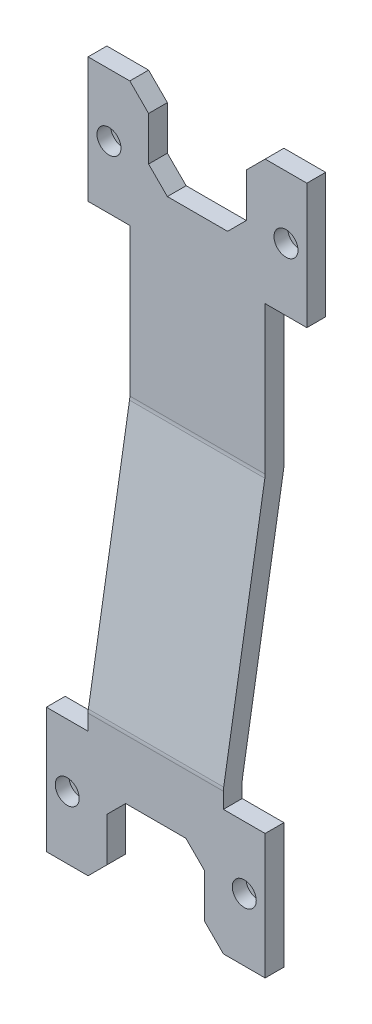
ISO-10303-21;
HEADER;
FILE_DESCRIPTION(('STEP AP214'),'2;1');
FILE_NAME('part.step','',(''),(''),'','','');
FILE_SCHEMA(('AUTOMOTIVE_DESIGN { 1 0 10303 214 1 1 1 1 }'));
ENDSEC;
DATA;
#1=APPLICATION_CONTEXT('core data for automotive mechanical design processes');
#2=APPLICATION_PROTOCOL_DEFINITION('international standard','automotive_design',2000,#1);
#3=PRODUCT_CONTEXT('',#1,'mechanical');
#4=PRODUCT('Part','Part','',(#3));
#5=PRODUCT_RELATED_PRODUCT_CATEGORY('part','',(#4));
#6=PRODUCT_DEFINITION_FORMATION('','',#4);
#7=PRODUCT_DEFINITION_CONTEXT('part definition',#1,'design');
#8=PRODUCT_DEFINITION('design','',#6,#7);
#9=PRODUCT_DEFINITION_SHAPE('','',#8);
#10=(LENGTH_UNIT() NAMED_UNIT(*) SI_UNIT(.MILLI.,.METRE.));
#11=(NAMED_UNIT(*) PLANE_ANGLE_UNIT() SI_UNIT($,.RADIAN.));
#12=(NAMED_UNIT(*) SI_UNIT($,.STERADIAN.) SOLID_ANGLE_UNIT());
#13=UNCERTAINTY_MEASURE_WITH_UNIT(LENGTH_MEASURE(1.E-05),#10,'distance_accuracy_value','');
#14=(GEOMETRIC_REPRESENTATION_CONTEXT(3) GLOBAL_UNCERTAINTY_ASSIGNED_CONTEXT((#13)) GLOBAL_UNIT_ASSIGNED_CONTEXT((#10,
#11,#12)) REPRESENTATION_CONTEXT('',''));
#15=CARTESIAN_POINT('',(0.,0.,0.));
#16=DIRECTION('',(0.,0.,1.));
#17=DIRECTION('',(1.,0.,0.));
#18=AXIS2_PLACEMENT_3D('',#15,#16,#17);
#19=CARTESIAN_POINT('',(21.215663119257,64.99,-15.));
#20=DIRECTION('',(0.,0.,1.));
#21=DIRECTION('',(1.,0.,0.));
#22=AXIS2_PLACEMENT_3D('',#19,#20,#21);
#23=CYLINDRICAL_SURFACE('',#22,1.55);
#24=CARTESIAN_POINT('',(21.215663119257,64.99,-14.5));
#25=DIRECTION('',(0.,0.,1.));
#26=DIRECTION('',(1.,0.,0.));
#27=AXIS2_PLACEMENT_3D('',#24,#25,#26);
#28=CIRCLE('',#27,1.55);
#29=CARTESIAN_POINT('',(22.765663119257,64.99,-14.5));
#30=VERTEX_POINT('',#29);
#31=EDGE_CURVE('E644',#30,#30,#28,.F.);
#32=ORIENTED_EDGE('',*,*,#31,.T.);
#33=EDGE_LOOP('',(#32));
#34=FACE_BOUND('',#33,.T.);
#35=CARTESIAN_POINT('',(21.215663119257,64.99,-13.3));
#36=DIRECTION('',(0.,0.,1.));
#37=DIRECTION('',(1.,0.,0.));
#38=AXIS2_PLACEMENT_3D('',#35,#36,#37);
#39=CIRCLE('',#38,1.55);
#40=CARTESIAN_POINT('',(22.765663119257,64.99,-13.3));
#41=VERTEX_POINT('',#40);
#42=EDGE_CURVE('E347',#41,#41,#39,.F.);
#43=ORIENTED_EDGE('',*,*,#42,.F.);
#44=EDGE_LOOP('',(#43));
#45=FACE_BOUND('',#44,.T.);
#46=ADVANCED_FACE('F36',(#34,#45),#23,.F.);
#47=CARTESIAN_POINT('',(-21.2156631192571,64.99,-15.));
#48=DIRECTION('',(0.,0.,1.));
#49=DIRECTION('',(1.,0.,0.));
#50=AXIS2_PLACEMENT_3D('',#47,#48,#49);
#51=CYLINDRICAL_SURFACE('',#50,1.55);
#52=CARTESIAN_POINT('',(-21.2156631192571,64.99,-14.5));
#53=DIRECTION('',(0.,0.,1.));
#54=DIRECTION('',(1.,0.,0.));
#55=AXIS2_PLACEMENT_3D('',#52,#53,#54);
#56=CIRCLE('',#55,1.55);
#57=CARTESIAN_POINT('',(-19.6656631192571,64.99,-14.5));
#58=VERTEX_POINT('',#57);
#59=EDGE_CURVE('E641',#58,#58,#56,.F.);
#60=ORIENTED_EDGE('',*,*,#59,.T.);
#61=EDGE_LOOP('',(#60));
#62=FACE_BOUND('',#61,.T.);
#63=CARTESIAN_POINT('',(-21.2156631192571,64.99,-13.3));
#64=DIRECTION('',(0.,0.,1.));
#65=DIRECTION('',(1.,0.,0.));
#66=AXIS2_PLACEMENT_3D('',#63,#64,#65);
#67=CIRCLE('',#66,1.55);
#68=CARTESIAN_POINT('',(-19.6656631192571,64.99,-13.3));
#69=VERTEX_POINT('',#68);
#70=EDGE_CURVE('E344',#69,#69,#67,.F.);
#71=ORIENTED_EDGE('',*,*,#70,.F.);
#72=EDGE_LOOP('',(#71));
#73=FACE_BOUND('',#72,.T.);
#74=ADVANCED_FACE('F747',(#62,#73),#51,.F.);
#75=CARTESIAN_POINT('',(-21.215663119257,-64.99,-15.));
#76=DIRECTION('',(0.,0.,1.));
#77=DIRECTION('',(1.,0.,0.));
#78=AXIS2_PLACEMENT_3D('',#75,#76,#77);
#79=CYLINDRICAL_SURFACE('',#78,1.55);
#80=CARTESIAN_POINT('',(-21.215663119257,-64.99,-4.5));
#81=DIRECTION('',(0.,0.,1.));
#82=DIRECTION('',(0.,-1.,0.));
#83=AXIS2_PLACEMENT_3D('',#80,#81,#82);
#84=CIRCLE('',#83,1.55);
#85=CARTESIAN_POINT('',(-21.215663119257,-66.54,-4.5));
#86=VERTEX_POINT('',#85);
#87=EDGE_CURVE('E417',#86,#86,#84,.F.);
#88=ORIENTED_EDGE('',*,*,#87,.T.);
#89=EDGE_LOOP('',(#88));
#90=FACE_BOUND('',#89,.T.);
#91=CARTESIAN_POINT('',(-21.215663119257,-64.99,-3.3));
#92=DIRECTION('',(0.,0.,1.));
#93=DIRECTION('',(1.,0.,0.));
#94=AXIS2_PLACEMENT_3D('',#91,#92,#93);
#95=CIRCLE('',#94,1.55);
#96=CARTESIAN_POINT('',(-19.665663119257,-64.99,-3.3));
#97=VERTEX_POINT('',#96);
#98=EDGE_CURVE('E339',#97,#97,#95,.F.);
#99=ORIENTED_EDGE('',*,*,#98,.F.);
#100=EDGE_LOOP('',(#99));
#101=FACE_BOUND('',#100,.T.);
#102=ADVANCED_FACE('F753',(#90,#101),#79,.F.);
#103=CARTESIAN_POINT('',(21.215663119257,-64.99,-15.));
#104=DIRECTION('',(0.,0.,1.));
#105=DIRECTION('',(1.,0.,0.));
#106=AXIS2_PLACEMENT_3D('',#103,#104,#105);
#107=CYLINDRICAL_SURFACE('',#106,1.55);
#108=CARTESIAN_POINT('',(21.215663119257,-64.99,-4.5));
#109=DIRECTION('',(0.,0.,1.));
#110=DIRECTION('',(0.,-1.,0.));
#111=AXIS2_PLACEMENT_3D('',#108,#109,#110);
#112=CIRCLE('',#111,1.55);
#113=CARTESIAN_POINT('',(21.215663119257,-66.54,-4.5));
#114=VERTEX_POINT('',#113);
#115=EDGE_CURVE('E414',#114,#114,#112,.F.);
#116=ORIENTED_EDGE('',*,*,#115,.T.);
#117=EDGE_LOOP('',(#116));
#118=FACE_BOUND('',#117,.T.);
#119=CARTESIAN_POINT('',(21.215663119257,-64.99,-3.3));
#120=DIRECTION('',(0.,0.,1.));
#121=DIRECTION('',(1.,0.,0.));
#122=AXIS2_PLACEMENT_3D('',#119,#120,#121);
#123=CIRCLE('',#122,1.55);
#124=CARTESIAN_POINT('',(22.765663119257,-64.99,-3.3));
#125=VERTEX_POINT('',#124);
#126=EDGE_CURVE('E336',#125,#125,#123,.F.);
#127=ORIENTED_EDGE('',*,*,#126,.F.);
#128=EDGE_LOOP('',(#127));
#129=FACE_BOUND('',#128,.T.);
#130=ADVANCED_FACE('F758',(#118,#129),#107,.F.);
#131=CARTESIAN_POINT('',(26.2156631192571,-49.99,-5.));
#132=DIRECTION('',(0.,1.,0.));
#133=DIRECTION('',(0.,0.,1.));
#134=AXIS2_PLACEMENT_3D('',#131,#132,#133);
#135=PLANE('',#134);
#136=DIRECTION('',(1.,0.,0.));
#137=VECTOR('',#136,1.);
#138=CARTESIAN_POINT('',(26.2156631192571,-49.99,-4.50000000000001));
#139=LINE('',#138,#137);
#140=CARTESIAN_POINT('',(16.215663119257,-49.99,-4.50000000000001));
#141=VERTEX_POINT('',#140);
#142=CARTESIAN_POINT('',(26.2156631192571,-49.99,-4.50000000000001));
#143=VERTEX_POINT('',#142);
#144=EDGE_CURVE('E389',#141,#143,#139,.T.);
#145=ORIENTED_EDGE('',*,*,#144,.F.);
#146=DIRECTION('',(0.,0.,1.));
#147=VECTOR('',#146,1.);
#148=CARTESIAN_POINT('',(16.215663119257,-49.99,-5.));
#149=LINE('',#148,#147);
#150=CARTESIAN_POINT('',(16.215663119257,-49.99,0.));
#151=VERTEX_POINT('',#150);
#152=EDGE_CURVE('E322',#141,#151,#149,.T.);
#153=ORIENTED_EDGE('',*,*,#152,.T.);
#154=DIRECTION('',(-1.,0.,0.));
#155=VECTOR('',#154,1.);
#156=CARTESIAN_POINT('',(26.2156631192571,-49.99,0.));
#157=LINE('',#156,#155);
#158=CARTESIAN_POINT('',(26.2156631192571,-49.99,0.));
#159=VERTEX_POINT('',#158);
#160=EDGE_CURVE('E387',#159,#151,#157,.T.);
#161=ORIENTED_EDGE('',*,*,#160,.F.);
#162=DIRECTION('',(0.,0.,1.));
#163=VECTOR('',#162,1.);
#164=CARTESIAN_POINT('',(26.2156631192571,-49.99,-5.));
#165=LINE('',#164,#163);
#166=EDGE_CURVE('E328',#143,#159,#165,.T.);
#167=ORIENTED_EDGE('',*,*,#166,.F.);
#168=EDGE_LOOP('',(#145,#153,#161,#167));
#169=FACE_BOUND('',#168,.T.);
#170=ADVANCED_FACE('F38',(#169),#135,.T.);
#171=CARTESIAN_POINT('',(26.2156631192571,-79.99,-5.));
#172=DIRECTION('',(1.,0.,0.));
#173=DIRECTION('',(0.,0.,-1.));
#174=AXIS2_PLACEMENT_3D('',#171,#172,#173);
#175=PLANE('',#174);
#176=DIRECTION('',(0.,-1.,0.));
#177=VECTOR('',#176,1.);
#178=CARTESIAN_POINT('',(26.2156631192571,-79.99,-4.5));
#179=LINE('',#178,#177);
#180=CARTESIAN_POINT('',(26.2156631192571,-79.99,-4.5));
#181=VERTEX_POINT('',#180);
#182=EDGE_CURVE('E279',#143,#181,#179,.T.);
#183=ORIENTED_EDGE('',*,*,#182,.F.);
#184=ORIENTED_EDGE('',*,*,#166,.T.);
#185=DIRECTION('',(0.,1.,0.));
#186=VECTOR('',#185,1.);
#187=CARTESIAN_POINT('',(26.2156631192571,-79.99,0.));
#188=LINE('',#187,#186);
#189=CARTESIAN_POINT('',(26.2156631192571,-79.99,0.));
#190=VERTEX_POINT('',#189);
#191=EDGE_CURVE('E324',#190,#159,#188,.T.);
#192=ORIENTED_EDGE('',*,*,#191,.F.);
#193=DIRECTION('',(0.,0.,1.));
#194=VECTOR('',#193,1.);
#195=CARTESIAN_POINT('',(26.2156631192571,-79.99,-5.));
#196=LINE('',#195,#194);
#197=EDGE_CURVE('E534',#181,#190,#196,.T.);
#198=ORIENTED_EDGE('',*,*,#197,.F.);
#199=EDGE_LOOP('',(#183,#184,#192,#198));
#200=FACE_BOUND('',#199,.T.);
#201=ADVANCED_FACE('F689',(#200),#175,.T.);
#202=CARTESIAN_POINT('',(16.2156631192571,-79.99,-5.));
#203=DIRECTION('',(0.,-1.,0.));
#204=DIRECTION('',(0.,0.,-1.));
#205=AXIS2_PLACEMENT_3D('',#202,#203,#204);
#206=PLANE('',#205);
#207=DIRECTION('',(1.,0.,0.));
#208=VECTOR('',#207,1.);
#209=CARTESIAN_POINT('',(-26.2156631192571,-79.99,-4.5));
#210=LINE('',#209,#208);
#211=CARTESIAN_POINT('',(16.2156631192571,-79.99,-4.5));
#212=VERTEX_POINT('',#211);
#213=EDGE_CURVE('E375',#212,#181,#210,.T.);
#214=ORIENTED_EDGE('',*,*,#213,.T.);
#215=ORIENTED_EDGE('',*,*,#197,.T.);
#216=DIRECTION('',(1.,0.,0.));
#217=VECTOR('',#216,1.);
#218=CARTESIAN_POINT('',(16.2156631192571,-79.99,0.));
#219=LINE('',#218,#217);
#220=CARTESIAN_POINT('',(16.2156631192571,-79.99,0.));
#221=VERTEX_POINT('',#220);
#222=EDGE_CURVE('E529',#221,#190,#219,.T.);
#223=ORIENTED_EDGE('',*,*,#222,.F.);
#224=DIRECTION('',(0.,0.,1.));
#225=VECTOR('',#224,1.);
#226=CARTESIAN_POINT('',(16.2156631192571,-79.99,-5.));
#227=LINE('',#226,#225);
#228=EDGE_CURVE('E536',#212,#221,#227,.T.);
#229=ORIENTED_EDGE('',*,*,#228,.F.);
#230=EDGE_LOOP('',(#214,#215,#223,#229));
#231=FACE_BOUND('',#230,.T.);
#232=ADVANCED_FACE('F684',(#231),#206,.T.);
#233=CARTESIAN_POINT('',(16.2156631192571,-79.99,-5.));
#234=DIRECTION('',(-0.707106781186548,-0.707106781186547,0.));
#235=DIRECTION('',(0.707106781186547,-0.707106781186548,0.));
#236=AXIS2_PLACEMENT_3D('',#233,#234,#235);
#237=PLANE('',#236);
#238=DIRECTION('',(-0.707106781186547,0.707106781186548,0.));
#239=VECTOR('',#238,1.);
#240=CARTESIAN_POINT('',(16.2156631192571,-79.99,-4.5));
#241=LINE('',#240,#239);
#242=CARTESIAN_POINT('',(11.715663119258,-75.4900000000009,-4.5));
#243=VERTEX_POINT('',#242);
#244=EDGE_CURVE('E412',#212,#243,#241,.T.);
#245=ORIENTED_EDGE('',*,*,#244,.F.);
#246=ORIENTED_EDGE('',*,*,#228,.T.);
#247=DIRECTION('',(0.707106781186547,-0.707106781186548,0.));
#248=VECTOR('',#247,1.);
#249=CARTESIAN_POINT('',(16.2156631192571,-79.99,0.));
#250=LINE('',#249,#248);
#251=CARTESIAN_POINT('',(11.715663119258,-75.4900000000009,0.));
#252=VERTEX_POINT('',#251);
#253=EDGE_CURVE('E526',#252,#221,#250,.T.);
#254=ORIENTED_EDGE('',*,*,#253,.F.);
#255=DIRECTION('',(0.,0.,1.));
#256=VECTOR('',#255,1.);
#257=CARTESIAN_POINT('',(11.715663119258,-75.4900000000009,-5.));
#258=LINE('',#257,#256);
#259=EDGE_CURVE('E538',#243,#252,#258,.T.);
#260=ORIENTED_EDGE('',*,*,#259,.F.);
#261=EDGE_LOOP('',(#245,#246,#254,#260));
#262=FACE_BOUND('',#261,.T.);
#263=ADVANCED_FACE('F696',(#262),#237,.T.);
#264=CARTESIAN_POINT('',(11.715663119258,-75.4900000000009,-5.));
#265=DIRECTION('',(-1.,0.,0.));
#266=DIRECTION('',(0.,-1.,0.));
#267=AXIS2_PLACEMENT_3D('',#264,#265,#266);
#268=PLANE('',#267);
#269=DIRECTION('',(0.,1.,0.));
#270=VECTOR('',#269,1.);
#271=CARTESIAN_POINT('',(11.715663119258,-75.4900000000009,-4.5));
#272=LINE('',#271,#270);
#273=CARTESIAN_POINT('',(11.715663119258,-64.99,-4.5));
#274=VERTEX_POINT('',#273);
#275=EDGE_CURVE('E410',#243,#274,#272,.T.);
#276=ORIENTED_EDGE('',*,*,#275,.F.);
#277=ORIENTED_EDGE('',*,*,#259,.T.);
#278=DIRECTION('',(0.,-1.,0.));
#279=VECTOR('',#278,1.);
#280=CARTESIAN_POINT('',(11.715663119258,-75.4900000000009,0.));
#281=LINE('',#280,#279);
#282=CARTESIAN_POINT('',(11.715663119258,-64.99,0.));
#283=VERTEX_POINT('',#282);
#284=EDGE_CURVE('E523',#283,#252,#281,.T.);
#285=ORIENTED_EDGE('',*,*,#284,.F.);
#286=DIRECTION('',(0.,0.,1.));
#287=VECTOR('',#286,1.);
#288=CARTESIAN_POINT('',(11.715663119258,-64.99,-5.));
#289=LINE('',#288,#287);
#290=EDGE_CURVE('E540',#274,#283,#289,.T.);
#291=ORIENTED_EDGE('',*,*,#290,.F.);
#292=EDGE_LOOP('',(#276,#277,#285,#291));
#293=FACE_BOUND('',#292,.T.);
#294=ADVANCED_FACE('F701',(#293),#268,.T.);
#295=CARTESIAN_POINT('',(11.715663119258,-64.99,-5.));
#296=DIRECTION('',(-0.707106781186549,-0.707106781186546,0.));
#297=DIRECTION('',(0.707106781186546,-0.707106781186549,0.));
#298=AXIS2_PLACEMENT_3D('',#295,#296,#297);
#299=PLANE('',#298);
#300=DIRECTION('',(-0.707106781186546,0.707106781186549,0.));
#301=VECTOR('',#300,1.);
#302=CARTESIAN_POINT('',(11.715663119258,-64.99,-4.5));
#303=LINE('',#302,#301);
#304=CARTESIAN_POINT('',(7.21566311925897,-60.4900000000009,-4.5));
#305=VERTEX_POINT('',#304);
#306=EDGE_CURVE('E408',#274,#305,#303,.T.);
#307=ORIENTED_EDGE('',*,*,#306,.F.);
#308=ORIENTED_EDGE('',*,*,#290,.T.);
#309=DIRECTION('',(0.707106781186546,-0.707106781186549,0.));
#310=VECTOR('',#309,1.);
#311=CARTESIAN_POINT('',(11.715663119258,-64.99,0.));
#312=LINE('',#311,#310);
#313=CARTESIAN_POINT('',(7.21566311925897,-60.4900000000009,0.));
#314=VERTEX_POINT('',#313);
#315=EDGE_CURVE('E520',#314,#283,#312,.T.);
#316=ORIENTED_EDGE('',*,*,#315,.F.);
#317=DIRECTION('',(0.,0.,1.));
#318=VECTOR('',#317,1.);
#319=CARTESIAN_POINT('',(7.21566311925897,-60.4900000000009,-5.));
#320=LINE('',#319,#318);
#321=EDGE_CURVE('E542',#305,#314,#320,.T.);
#322=ORIENTED_EDGE('',*,*,#321,.F.);
#323=EDGE_LOOP('',(#307,#308,#316,#322));
#324=FACE_BOUND('',#323,.T.);
#325=ADVANCED_FACE('F704',(#324),#299,.T.);
#326=CARTESIAN_POINT('',(-7.21566311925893,-60.4900000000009,-5.));
#327=DIRECTION('',(0.,-1.,0.));
#328=DIRECTION('',(0.,0.,-1.));
#329=AXIS2_PLACEMENT_3D('',#326,#327,#328);
#330=PLANE('',#329);
#331=DIRECTION('',(-1.,0.,0.));
#332=VECTOR('',#331,1.);
#333=CARTESIAN_POINT('',(-7.21566311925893,-60.4900000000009,-4.5));
#334=LINE('',#333,#332);
#335=CARTESIAN_POINT('',(-7.21566311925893,-60.4900000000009,-4.5));
#336=VERTEX_POINT('',#335);
#337=EDGE_CURVE('E406',#305,#336,#334,.T.);
#338=ORIENTED_EDGE('',*,*,#337,.F.);
#339=ORIENTED_EDGE('',*,*,#321,.T.);
#340=DIRECTION('',(1.,0.,0.));
#341=VECTOR('',#340,1.);
#342=CARTESIAN_POINT('',(-7.21566311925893,-60.4900000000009,0.));
#343=LINE('',#342,#341);
#344=CARTESIAN_POINT('',(-7.21566311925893,-60.4900000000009,0.));
#345=VERTEX_POINT('',#344);
#346=EDGE_CURVE('E517',#345,#314,#343,.T.);
#347=ORIENTED_EDGE('',*,*,#346,.F.);
#348=DIRECTION('',(0.,0.,1.));
#349=VECTOR('',#348,1.);
#350=CARTESIAN_POINT('',(-7.21566311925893,-60.4900000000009,-5.));
#351=LINE('',#350,#349);
#352=EDGE_CURVE('E544',#336,#345,#351,.T.);
#353=ORIENTED_EDGE('',*,*,#352,.F.);
#354=EDGE_LOOP('',(#338,#339,#347,#353));
#355=FACE_BOUND('',#354,.T.);
#356=ADVANCED_FACE('F710',(#355),#330,.T.);
#357=CARTESIAN_POINT('',(-11.715663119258,-64.99,-5.));
#358=DIRECTION('',(0.707106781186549,-0.707106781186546,0.));
#359=DIRECTION('',(0.707106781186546,0.707106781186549,0.));
#360=AXIS2_PLACEMENT_3D('',#357,#358,#359);
#361=PLANE('',#360);
#362=DIRECTION('',(-0.707106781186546,-0.707106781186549,0.));
#363=VECTOR('',#362,1.);
#364=CARTESIAN_POINT('',(-11.715663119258,-64.99,-4.5));
#365=LINE('',#364,#363);
#366=CARTESIAN_POINT('',(-11.715663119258,-64.99,-4.5));
#367=VERTEX_POINT('',#366);
#368=EDGE_CURVE('E404',#336,#367,#365,.T.);
#369=ORIENTED_EDGE('',*,*,#368,.F.);
#370=ORIENTED_EDGE('',*,*,#352,.T.);
#371=DIRECTION('',(0.707106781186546,0.707106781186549,0.));
#372=VECTOR('',#371,1.);
#373=CARTESIAN_POINT('',(-11.715663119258,-64.99,0.));
#374=LINE('',#373,#372);
#375=CARTESIAN_POINT('',(-11.715663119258,-64.99,0.));
#376=VERTEX_POINT('',#375);
#377=EDGE_CURVE('E514',#376,#345,#374,.T.);
#378=ORIENTED_EDGE('',*,*,#377,.F.);
#379=DIRECTION('',(0.,0.,1.));
#380=VECTOR('',#379,1.);
#381=CARTESIAN_POINT('',(-11.715663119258,-64.99,-5.));
#382=LINE('',#381,#380);
#383=EDGE_CURVE('E546',#367,#376,#382,.T.);
#384=ORIENTED_EDGE('',*,*,#383,.F.);
#385=EDGE_LOOP('',(#369,#370,#378,#384));
#386=FACE_BOUND('',#385,.T.);
#387=ADVANCED_FACE('F714',(#386),#361,.T.);
#388=CARTESIAN_POINT('',(-11.715663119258,-75.4900000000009,-5.));
#389=DIRECTION('',(1.,0.,0.));
#390=DIRECTION('',(0.,0.,-1.));
#391=AXIS2_PLACEMENT_3D('',#388,#389,#390);
#392=PLANE('',#391);
#393=DIRECTION('',(0.,-1.,0.));
#394=VECTOR('',#393,1.);
#395=CARTESIAN_POINT('',(-11.715663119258,-75.4900000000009,-4.5));
#396=LINE('',#395,#394);
#397=CARTESIAN_POINT('',(-11.715663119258,-75.4900000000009,-4.5));
#398=VERTEX_POINT('',#397);
#399=EDGE_CURVE('E402',#367,#398,#396,.T.);
#400=ORIENTED_EDGE('',*,*,#399,.F.);
#401=ORIENTED_EDGE('',*,*,#383,.T.);
#402=DIRECTION('',(0.,1.,0.));
#403=VECTOR('',#402,1.);
#404=CARTESIAN_POINT('',(-11.715663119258,-75.4900000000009,0.));
#405=LINE('',#404,#403);
#406=CARTESIAN_POINT('',(-11.715663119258,-75.4900000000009,0.));
#407=VERTEX_POINT('',#406);
#408=EDGE_CURVE('E511',#407,#376,#405,.T.);
#409=ORIENTED_EDGE('',*,*,#408,.F.);
#410=DIRECTION('',(0.,0.,1.));
#411=VECTOR('',#410,1.);
#412=CARTESIAN_POINT('',(-11.715663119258,-75.4900000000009,-5.));
#413=LINE('',#412,#411);
#414=EDGE_CURVE('E548',#398,#407,#413,.T.);
#415=ORIENTED_EDGE('',*,*,#414,.F.);
#416=EDGE_LOOP('',(#400,#401,#409,#415));
#417=FACE_BOUND('',#416,.T.);
#418=ADVANCED_FACE('F720',(#417),#392,.T.);
#419=CARTESIAN_POINT('',(-16.215663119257,-79.99,-5.));
#420=DIRECTION('',(0.707106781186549,-0.707106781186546,0.));
#421=DIRECTION('',(0.707106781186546,0.707106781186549,0.));
#422=AXIS2_PLACEMENT_3D('',#419,#420,#421);
#423=PLANE('',#422);
#424=DIRECTION('',(-0.707106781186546,-0.707106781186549,0.));
#425=VECTOR('',#424,1.);
#426=CARTESIAN_POINT('',(-16.215663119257,-79.99,-4.5));
#427=LINE('',#426,#425);
#428=CARTESIAN_POINT('',(-16.215663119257,-79.99,-4.5));
#429=VERTEX_POINT('',#428);
#430=EDGE_CURVE('E400',#398,#429,#427,.T.);
#431=ORIENTED_EDGE('',*,*,#430,.F.);
#432=ORIENTED_EDGE('',*,*,#414,.T.);
#433=DIRECTION('',(0.707106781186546,0.707106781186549,0.));
#434=VECTOR('',#433,1.);
#435=CARTESIAN_POINT('',(-16.215663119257,-79.99,0.));
#436=LINE('',#435,#434);
#437=CARTESIAN_POINT('',(-16.215663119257,-79.99,0.));
#438=VERTEX_POINT('',#437);
#439=EDGE_CURVE('E508',#438,#407,#436,.T.);
#440=ORIENTED_EDGE('',*,*,#439,.F.);
#441=DIRECTION('',(0.,0.,1.));
#442=VECTOR('',#441,1.);
#443=CARTESIAN_POINT('',(-16.215663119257,-79.99,-5.));
#444=LINE('',#443,#442);
#445=EDGE_CURVE('E550',#429,#438,#444,.T.);
#446=ORIENTED_EDGE('',*,*,#445,.F.);
#447=EDGE_LOOP('',(#431,#432,#440,#446));
#448=FACE_BOUND('',#447,.T.);
#449=ADVANCED_FACE('F724',(#448),#423,.T.);
#450=CARTESIAN_POINT('',(-26.215663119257,-79.99,-5.));
#451=DIRECTION('',(0.,-1.,0.));
#452=DIRECTION('',(0.,0.,-1.));
#453=AXIS2_PLACEMENT_3D('',#450,#451,#452);
#454=PLANE('',#453);
#455=CARTESIAN_POINT('',(-26.2156631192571,-79.99,-4.5));
#456=VERTEX_POINT('',#455);
#457=EDGE_CURVE('E665',#456,#429,#210,.T.);
#458=ORIENTED_EDGE('',*,*,#457,.T.);
#459=ORIENTED_EDGE('',*,*,#445,.T.);
#460=DIRECTION('',(1.,0.,0.));
#461=VECTOR('',#460,1.);
#462=CARTESIAN_POINT('',(-26.215663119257,-79.99,0.));
#463=LINE('',#462,#461);
#464=CARTESIAN_POINT('',(-26.215663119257,-79.99,0.));
#465=VERTEX_POINT('',#464);
#466=EDGE_CURVE('E505',#465,#438,#463,.T.);
#467=ORIENTED_EDGE('',*,*,#466,.F.);
#468=DIRECTION('',(0.,0.,1.));
#469=VECTOR('',#468,1.);
#470=CARTESIAN_POINT('',(-26.215663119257,-79.99,-5.));
#471=LINE('',#470,#469);
#472=EDGE_CURVE('E552',#456,#465,#471,.T.);
#473=ORIENTED_EDGE('',*,*,#472,.F.);
#474=EDGE_LOOP('',(#458,#459,#467,#473));
#475=FACE_BOUND('',#474,.T.);
#476=ADVANCED_FACE('F847',(#475),#454,.T.);
#477=CARTESIAN_POINT('',(-26.215663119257,-49.99,-5.));
#478=DIRECTION('',(-1.,0.,0.));
#479=DIRECTION('',(0.,-1.,0.));
#480=AXIS2_PLACEMENT_3D('',#477,#478,#479);
#481=PLANE('',#480);
#482=DIRECTION('',(0.,-1.,0.));
#483=VECTOR('',#482,1.);
#484=CARTESIAN_POINT('',(-26.2156631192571,-46.6462528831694,-4.5));
#485=LINE('',#484,#483);
#486=CARTESIAN_POINT('',(-26.2156631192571,-49.99,-4.50000000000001));
#487=VERTEX_POINT('',#486);
#488=EDGE_CURVE('E278',#487,#456,#485,.T.);
#489=ORIENTED_EDGE('',*,*,#488,.T.);
#490=ORIENTED_EDGE('',*,*,#472,.T.);
#491=DIRECTION('',(0.,-1.,0.));
#492=VECTOR('',#491,1.);
#493=CARTESIAN_POINT('',(-26.215663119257,-49.99,0.));
#494=LINE('',#493,#492);
#495=CARTESIAN_POINT('',(-26.215663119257,-49.99,0.));
#496=VERTEX_POINT('',#495);
#497=EDGE_CURVE('E502',#496,#465,#494,.T.);
#498=ORIENTED_EDGE('',*,*,#497,.F.);
#499=DIRECTION('',(0.,0.,1.));
#500=VECTOR('',#499,1.);
#501=CARTESIAN_POINT('',(-26.215663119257,-49.99,-5.));
#502=LINE('',#501,#500);
#503=EDGE_CURVE('E554',#487,#496,#502,.T.);
#504=ORIENTED_EDGE('',*,*,#503,.F.);
#505=EDGE_LOOP('',(#489,#490,#498,#504));
#506=FACE_BOUND('',#505,.T.);
#507=ADVANCED_FACE('F731',(#506),#481,.T.);
#508=CARTESIAN_POINT('',(-16.215663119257,-49.99,-5.));
#509=DIRECTION('',(0.,1.,0.));
#510=DIRECTION('',(0.,0.,1.));
#511=AXIS2_PLACEMENT_3D('',#508,#509,#510);
#512=PLANE('',#511);
#513=DIRECTION('',(1.,0.,0.));
#514=VECTOR('',#513,1.);
#515=CARTESIAN_POINT('',(-16.215663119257,-49.99,-4.50000000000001));
#516=LINE('',#515,#514);
#517=CARTESIAN_POINT('',(-16.215663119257,-49.99,-4.50000000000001));
#518=VERTEX_POINT('',#517);
#519=EDGE_CURVE('E393',#487,#518,#516,.T.);
#520=ORIENTED_EDGE('',*,*,#519,.F.);
#521=ORIENTED_EDGE('',*,*,#503,.T.);
#522=DIRECTION('',(-1.,0.,0.));
#523=VECTOR('',#522,1.);
#524=CARTESIAN_POINT('',(-16.215663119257,-49.99,0.));
#525=LINE('',#524,#523);
#526=CARTESIAN_POINT('',(-16.215663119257,-49.99,0.));
#527=VERTEX_POINT('',#526);
#528=EDGE_CURVE('E499',#527,#496,#525,.T.);
#529=ORIENTED_EDGE('',*,*,#528,.F.);
#530=DIRECTION('',(0.,0.,1.));
#531=VECTOR('',#530,1.);
#532=CARTESIAN_POINT('',(-16.215663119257,-49.99,-5.));
#533=LINE('',#532,#531);
#534=EDGE_CURVE('E556',#518,#527,#533,.T.);
#535=ORIENTED_EDGE('',*,*,#534,.F.);
#536=EDGE_LOOP('',(#520,#521,#529,#535));
#537=FACE_BOUND('',#536,.T.);
#538=ADVANCED_FACE('F728',(#537),#512,.T.);
#539=CARTESIAN_POINT('',(-16.215663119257,49.99,-5.));
#540=DIRECTION('',(-1.,0.,0.));
#541=DIRECTION('',(0.,0.,1.));
#542=AXIS2_PLACEMENT_3D('',#539,#540,#541);
#543=PLANE('',#542);
#544=DIRECTION('',(0.,1.,0.));
#545=VECTOR('',#544,1.);
#546=CARTESIAN_POINT('',(-16.215663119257,49.99,-4.50000000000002));
#547=LINE('',#546,#545);
#548=CARTESIAN_POINT('',(-16.215663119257,-46.6462528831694,-4.5));
#549=VERTEX_POINT('',#548);
#550=EDGE_CURVE('E374',#518,#549,#547,.T.);
#551=ORIENTED_EDGE('',*,*,#550,.F.);
#552=ORIENTED_EDGE('',*,*,#534,.T.);
#553=DIRECTION('',(0.,-1.,0.));
#554=VECTOR('',#553,1.);
#555=CARTESIAN_POINT('',(-16.215663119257,49.99,0.));
#556=LINE('',#555,#554);
#557=CARTESIAN_POINT('',(-16.215663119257,-46.2324402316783,0.));
#558=VERTEX_POINT('',#557);
#559=EDGE_CURVE('E496',#558,#527,#556,.T.);
#560=ORIENTED_EDGE('',*,*,#559,.F.);
#561=CARTESIAN_POINT('',(-16.215663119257,-46.2324402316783,-5.00000000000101));
#562=DIRECTION('',(-1.,0.,0.));
#563=DIRECTION('',(0.,0.,1.));
#564=AXIS2_PLACEMENT_3D('',#561,#562,#563);
#565=CIRCLE('',#564,5.00000000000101);
#566=CARTESIAN_POINT('',(-16.215663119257,-45.4104452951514,-0.0680303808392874));
#567=VERTEX_POINT('',#566);
#568=EDGE_CURVE('E59',#567,#558,#565,.F.);
#569=ORIENTED_EDGE('',*,*,#568,.F.);
#570=DIRECTION('',(0.,-0.986393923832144,0.164398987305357));
#571=VECTOR('',#570,1.);
#572=CARTESIAN_POINT('',(-16.215663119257,48.2113884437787,-15.6716693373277));
#573=LINE('',#572,#571);
#574=CARTESIAN_POINT('',(-16.215663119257,13.7731901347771,-9.93196961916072));
#575=VERTEX_POINT('',#574);
#576=EDGE_CURVE('E456',#575,#567,#573,.T.);
#577=ORIENTED_EDGE('',*,*,#576,.F.);
#578=CARTESIAN_POINT('',(-16.215663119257,14.595185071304,-4.99999999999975));
#579=DIRECTION('',(-1.,0.,0.));
#580=DIRECTION('',(0.,0.,1.));
#581=AXIS2_PLACEMENT_3D('',#578,#579,#580);
#582=CIRCLE('',#581,5.00000000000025);
#583=CARTESIAN_POINT('',(-16.215663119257,14.5951850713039,-10.));
#584=VERTEX_POINT('',#583);
#585=EDGE_CURVE('E458',#584,#575,#582,.T.);
#586=ORIENTED_EDGE('',*,*,#585,.F.);
#587=DIRECTION('',(0.,-1.,0.));
#588=VECTOR('',#587,1.);
#589=CARTESIAN_POINT('',(-16.215663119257,49.99,-9.99999999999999));
#590=LINE('',#589,#588);
#591=CARTESIAN_POINT('',(-16.215663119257,49.99,-9.99999999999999));
#592=VERTEX_POINT('',#591);
#593=EDGE_CURVE('E492',#592,#584,#590,.T.);
#594=ORIENTED_EDGE('',*,*,#593,.F.);
#595=DIRECTION('',(0.,0.,1.));
#596=VECTOR('',#595,1.);
#597=CARTESIAN_POINT('',(-16.215663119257,49.99,-5.));
#598=LINE('',#597,#596);
#599=CARTESIAN_POINT('',(-16.215663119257,49.99,-14.5));
#600=VERTEX_POINT('',#599);
#601=EDGE_CURVE('E297',#600,#592,#598,.T.);
#602=ORIENTED_EDGE('',*,*,#601,.F.);
#603=DIRECTION('',(0.,1.,0.));
#604=VECTOR('',#603,1.);
#605=CARTESIAN_POINT('',(-16.215663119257,49.99,-14.5));
#606=LINE('',#605,#604);
#607=CARTESIAN_POINT('',(-16.215663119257,14.1813724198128,-14.5));
#608=VERTEX_POINT('',#607);
#609=EDGE_CURVE('E635',#608,#600,#606,.T.);
#610=ORIENTED_EDGE('',*,*,#609,.F.);
#611=CARTESIAN_POINT('',(-16.215663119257,14.1813724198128,-10.));
#612=DIRECTION('',(-1.,0.,0.));
#613=DIRECTION('',(0.,0.,1.));
#614=AXIS2_PLACEMENT_3D('',#611,#612,#613);
#615=CIRCLE('',#614,4.5);
#616=CARTESIAN_POINT('',(-16.215663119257,13.4415769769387,-14.4387726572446));
#617=VERTEX_POINT('',#616);
#618=EDGE_CURVE('E647',#617,#608,#615,.F.);
#619=ORIENTED_EDGE('',*,*,#618,.F.);
#620=DIRECTION('',(0.,0.986393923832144,-0.164398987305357));
#621=VECTOR('',#620,1.);
#622=CARTESIAN_POINT('',(-16.215663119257,47.4715930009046,-20.1104419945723));
#623=LINE('',#622,#621);
#624=CARTESIAN_POINT('',(-16.215663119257,-45.7420584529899,-4.57483341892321));
#625=VERTEX_POINT('',#624);
#626=EDGE_CURVE('E395',#625,#617,#623,.T.);
#627=ORIENTED_EDGE('',*,*,#626,.F.);
#628=CARTESIAN_POINT('',(-16.215663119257,-46.6462528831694,-10.));
#629=DIRECTION('',(-1.,0.,0.));
#630=DIRECTION('',(0.,0.,1.));
#631=AXIS2_PLACEMENT_3D('',#628,#629,#630);
#632=CIRCLE('',#631,5.5);
#633=EDGE_CURVE('E391',#549,#625,#632,.T.);
#634=ORIENTED_EDGE('',*,*,#633,.F.);
#635=EDGE_LOOP('',(#551,#552,#560,#569,#577,#586,#594,#602,#610,#619,#627,#634));
#636=FACE_BOUND('',#635,.T.);
#637=ADVANCED_FACE('F568',(#636),#543,.T.);
#638=CARTESIAN_POINT('',(-26.215663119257,49.99,-5.));
#639=DIRECTION('',(0.,-1.,0.));
#640=DIRECTION('',(0.,0.,-1.));
#641=AXIS2_PLACEMENT_3D('',#638,#639,#640);
#642=PLANE('',#641);
#643=DIRECTION('',(-1.,0.,0.));
#644=VECTOR('',#643,1.);
#645=CARTESIAN_POINT('',(-26.215663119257,49.99,-14.5));
#646=LINE('',#645,#644);
#647=CARTESIAN_POINT('',(-26.2156631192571,49.99,-14.5));
#648=VERTEX_POINT('',#647);
#649=EDGE_CURVE('E274',#600,#648,#646,.T.);
#650=ORIENTED_EDGE('',*,*,#649,.F.);
#651=ORIENTED_EDGE('',*,*,#601,.T.);
#652=DIRECTION('',(1.,0.,0.));
#653=VECTOR('',#652,1.);
#654=CARTESIAN_POINT('',(-26.215663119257,49.99,-9.99999999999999));
#655=LINE('',#654,#653);
#656=CARTESIAN_POINT('',(-26.2156631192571,49.99,-9.99999999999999));
#657=VERTEX_POINT('',#656);
#658=EDGE_CURVE('E489',#657,#592,#655,.T.);
#659=ORIENTED_EDGE('',*,*,#658,.F.);
#660=DIRECTION('',(0.,0.,1.));
#661=VECTOR('',#660,1.);
#662=CARTESIAN_POINT('',(-26.215663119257,49.99,-5.));
#663=LINE('',#662,#661);
#664=EDGE_CURVE('E295',#648,#657,#663,.T.);
#665=ORIENTED_EDGE('',*,*,#664,.F.);
#666=EDGE_LOOP('',(#650,#651,#659,#665));
#667=FACE_BOUND('',#666,.T.);
#668=ADVANCED_FACE('F560',(#667),#642,.T.);
#669=CARTESIAN_POINT('',(-26.215663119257,79.99,-5.));
#670=DIRECTION('',(-1.,0.,0.));
#671=DIRECTION('',(0.,-1.,0.));
#672=AXIS2_PLACEMENT_3D('',#669,#670,#671);
#673=PLANE('',#672);
#674=DIRECTION('',(0.,-1.,0.));
#675=VECTOR('',#674,1.);
#676=CARTESIAN_POINT('',(-26.2156631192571,79.99,-14.5));
#677=LINE('',#676,#675);
#678=CARTESIAN_POINT('',(-26.2156631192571,79.99,-14.5));
#679=VERTEX_POINT('',#678);
#680=EDGE_CURVE('E267',#679,#648,#677,.T.);
#681=ORIENTED_EDGE('',*,*,#680,.T.);
#682=ORIENTED_EDGE('',*,*,#664,.T.);
#683=DIRECTION('',(0.,1.,0.));
#684=VECTOR('',#683,1.);
#685=CARTESIAN_POINT('',(-26.2156631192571,79.9948804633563,-9.99999999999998));
#686=LINE('',#685,#684);
#687=CARTESIAN_POINT('',(-26.2156631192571,79.99,-9.99999999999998));
#688=VERTEX_POINT('',#687);
#689=EDGE_CURVE('E294',#657,#688,#686,.T.);
#690=ORIENTED_EDGE('',*,*,#689,.T.);
#691=DIRECTION('',(0.,0.,1.));
#692=VECTOR('',#691,1.);
#693=CARTESIAN_POINT('',(-26.215663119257,79.99,-5.));
#694=LINE('',#693,#692);
#695=EDGE_CURVE('E285',#679,#688,#694,.T.);
#696=ORIENTED_EDGE('',*,*,#695,.F.);
#697=EDGE_LOOP('',(#681,#682,#690,#696));
#698=FACE_BOUND('',#697,.T.);
#699=ADVANCED_FACE('F292',(#698),#673,.T.);
#700=CARTESIAN_POINT('',(-16.215663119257,79.99,-5.));
#701=DIRECTION('',(0.,1.,0.));
#702=DIRECTION('',(0.,0.,1.));
#703=AXIS2_PLACEMENT_3D('',#700,#701,#702);
#704=PLANE('',#703);
#705=DIRECTION('',(1.,0.,0.));
#706=VECTOR('',#705,1.);
#707=CARTESIAN_POINT('',(-26.2156631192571,79.99,-14.5));
#708=LINE('',#707,#706);
#709=CARTESIAN_POINT('',(-16.215663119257,79.99,-14.5));
#710=VERTEX_POINT('',#709);
#711=EDGE_CURVE('E271',#679,#710,#708,.T.);
#712=ORIENTED_EDGE('',*,*,#711,.F.);
#713=ORIENTED_EDGE('',*,*,#695,.T.);
#714=DIRECTION('',(-1.,0.,0.));
#715=VECTOR('',#714,1.);
#716=CARTESIAN_POINT('',(-16.215663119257,79.99,-9.99999999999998));
#717=LINE('',#716,#715);
#718=CARTESIAN_POINT('',(-16.215663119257,79.99,-9.99999999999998));
#719=VERTEX_POINT('',#718);
#720=EDGE_CURVE('E487',#719,#688,#717,.T.);
#721=ORIENTED_EDGE('',*,*,#720,.F.);
#722=DIRECTION('',(0.,0.,1.));
#723=VECTOR('',#722,1.);
#724=CARTESIAN_POINT('',(-16.215663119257,79.99,-5.));
#725=LINE('',#724,#723);
#726=EDGE_CURVE('E287',#710,#719,#725,.T.);
#727=ORIENTED_EDGE('',*,*,#726,.F.);
#728=EDGE_LOOP('',(#712,#713,#721,#727));
#729=FACE_BOUND('',#728,.T.);
#730=ADVANCED_FACE('F283',(#729),#704,.T.);
#731=CARTESIAN_POINT('',(-16.215663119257,79.99,-5.));
#732=DIRECTION('',(0.707106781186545,0.70710678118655,0.));
#733=DIRECTION('',(-0.70710678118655,0.707106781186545,0.));
#734=AXIS2_PLACEMENT_3D('',#731,#732,#733);
#735=PLANE('',#734);
#736=DIRECTION('',(0.70710678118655,-0.707106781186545,0.));
#737=VECTOR('',#736,1.);
#738=CARTESIAN_POINT('',(-16.215663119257,79.99,-14.5));
#739=LINE('',#738,#737);
#740=CARTESIAN_POINT('',(-11.715663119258,75.4900000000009,-14.5));
#741=VERTEX_POINT('',#740);
#742=EDGE_CURVE('E633',#710,#741,#739,.T.);
#743=ORIENTED_EDGE('',*,*,#742,.F.);
#744=ORIENTED_EDGE('',*,*,#726,.T.);
#745=DIRECTION('',(-0.70710678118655,0.707106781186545,0.));
#746=VECTOR('',#745,1.);
#747=CARTESIAN_POINT('',(-16.215663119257,79.99,-9.99999999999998));
#748=LINE('',#747,#746);
#749=CARTESIAN_POINT('',(-11.715663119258,75.4900000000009,-9.99999999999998));
#750=VERTEX_POINT('',#749);
#751=EDGE_CURVE('E484',#750,#719,#748,.T.);
#752=ORIENTED_EDGE('',*,*,#751,.F.);
#753=DIRECTION('',(0.,0.,1.));
#754=VECTOR('',#753,1.);
#755=CARTESIAN_POINT('',(-11.715663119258,75.4900000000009,-5.));
#756=LINE('',#755,#754);
#757=EDGE_CURVE('E299',#741,#750,#756,.T.);
#758=ORIENTED_EDGE('',*,*,#757,.F.);
#759=EDGE_LOOP('',(#743,#744,#752,#758));
#760=FACE_BOUND('',#759,.T.);
#761=ADVANCED_FACE('F632',(#760),#735,.T.);
#762=CARTESIAN_POINT('',(-11.715663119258,75.4900000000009,-5.));
#763=DIRECTION('',(1.,0.,0.));
#764=DIRECTION('',(0.,0.,-1.));
#765=AXIS2_PLACEMENT_3D('',#762,#763,#764);
#766=PLANE('',#765);
#767=DIRECTION('',(0.,-1.,0.));
#768=VECTOR('',#767,1.);
#769=CARTESIAN_POINT('',(-11.715663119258,75.4900000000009,-14.5));
#770=LINE('',#769,#768);
#771=CARTESIAN_POINT('',(-11.715663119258,64.99,-14.5));
#772=VERTEX_POINT('',#771);
#773=EDGE_CURVE('E630',#741,#772,#770,.T.);
#774=ORIENTED_EDGE('',*,*,#773,.F.);
#775=ORIENTED_EDGE('',*,*,#757,.T.);
#776=DIRECTION('',(0.,1.,0.));
#777=VECTOR('',#776,1.);
#778=CARTESIAN_POINT('',(-11.715663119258,75.4900000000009,-9.99999999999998));
#779=LINE('',#778,#777);
#780=CARTESIAN_POINT('',(-11.715663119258,64.99,-9.99999999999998));
#781=VERTEX_POINT('',#780);
#782=EDGE_CURVE('E481',#781,#750,#779,.T.);
#783=ORIENTED_EDGE('',*,*,#782,.F.);
#784=DIRECTION('',(0.,0.,1.));
#785=VECTOR('',#784,1.);
#786=CARTESIAN_POINT('',(-11.715663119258,64.99,-5.));
#787=LINE('',#786,#785);
#788=EDGE_CURVE('E304',#772,#781,#787,.T.);
#789=ORIENTED_EDGE('',*,*,#788,.F.);
#790=EDGE_LOOP('',(#774,#775,#783,#789));
#791=FACE_BOUND('',#790,.T.);
#792=ADVANCED_FACE('F628',(#791),#766,.T.);
#793=CARTESIAN_POINT('',(-11.715663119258,64.99,-5.));
#794=DIRECTION('',(0.707106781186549,0.707106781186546,0.));
#795=DIRECTION('',(-0.707106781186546,0.707106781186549,0.));
#796=AXIS2_PLACEMENT_3D('',#793,#794,#795);
#797=PLANE('',#796);
#798=DIRECTION('',(0.707106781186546,-0.707106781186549,0.));
#799=VECTOR('',#798,1.);
#800=CARTESIAN_POINT('',(-11.715663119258,64.99,-14.5));
#801=LINE('',#800,#799);
#802=CARTESIAN_POINT('',(-7.21566311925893,60.4900000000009,-14.5));
#803=VERTEX_POINT('',#802);
#804=EDGE_CURVE('E622',#772,#803,#801,.T.);
#805=ORIENTED_EDGE('',*,*,#804,.F.);
#806=ORIENTED_EDGE('',*,*,#788,.T.);
#807=DIRECTION('',(-0.707106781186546,0.707106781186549,0.));
#808=VECTOR('',#807,1.);
#809=CARTESIAN_POINT('',(-11.715663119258,64.99,-9.99999999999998));
#810=LINE('',#809,#808);
#811=CARTESIAN_POINT('',(-7.21566311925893,60.4900000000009,-9.99999999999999));
#812=VERTEX_POINT('',#811);
#813=EDGE_CURVE('E478',#812,#781,#810,.T.);
#814=ORIENTED_EDGE('',*,*,#813,.F.);
#815=DIRECTION('',(0.,0.,1.));
#816=VECTOR('',#815,1.);
#817=CARTESIAN_POINT('',(-7.21566311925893,60.4900000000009,-5.));
#818=LINE('',#817,#816);
#819=EDGE_CURVE('E306',#803,#812,#818,.T.);
#820=ORIENTED_EDGE('',*,*,#819,.F.);
#821=EDGE_LOOP('',(#805,#806,#814,#820));
#822=FACE_BOUND('',#821,.T.);
#823=ADVANCED_FACE('F621',(#822),#797,.T.);
#824=CARTESIAN_POINT('',(-7.21566311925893,60.4900000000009,-5.));
#825=DIRECTION('',(0.,1.,0.));
#826=DIRECTION('',(0.,0.,1.));
#827=AXIS2_PLACEMENT_3D('',#824,#825,#826);
#828=PLANE('',#827);
#829=DIRECTION('',(1.,0.,0.));
#830=VECTOR('',#829,1.);
#831=CARTESIAN_POINT('',(-7.21566311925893,60.4900000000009,-14.5));
#832=LINE('',#831,#830);
#833=CARTESIAN_POINT('',(7.21566311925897,60.4900000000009,-14.5));
#834=VERTEX_POINT('',#833);
#835=EDGE_CURVE('E618',#803,#834,#832,.T.);
#836=ORIENTED_EDGE('',*,*,#835,.F.);
#837=ORIENTED_EDGE('',*,*,#819,.T.);
#838=DIRECTION('',(-1.,0.,0.));
#839=VECTOR('',#838,1.);
#840=CARTESIAN_POINT('',(-7.21566311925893,60.4900000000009,-9.99999999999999));
#841=LINE('',#840,#839);
#842=CARTESIAN_POINT('',(7.21566311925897,60.4900000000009,-9.99999999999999));
#843=VERTEX_POINT('',#842);
#844=EDGE_CURVE('E475',#843,#812,#841,.T.);
#845=ORIENTED_EDGE('',*,*,#844,.F.);
#846=DIRECTION('',(0.,0.,1.));
#847=VECTOR('',#846,1.);
#848=CARTESIAN_POINT('',(7.21566311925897,60.4900000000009,-5.));
#849=LINE('',#848,#847);
#850=EDGE_CURVE('E308',#834,#843,#849,.T.);
#851=ORIENTED_EDGE('',*,*,#850,.F.);
#852=EDGE_LOOP('',(#836,#837,#845,#851));
#853=FACE_BOUND('',#852,.T.);
#854=ADVANCED_FACE('F616',(#853),#828,.T.);
#855=CARTESIAN_POINT('',(11.715663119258,64.99,-5.));
#856=DIRECTION('',(-0.707106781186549,0.707106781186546,0.));
#857=DIRECTION('',(-0.707106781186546,-0.707106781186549,0.));
#858=AXIS2_PLACEMENT_3D('',#855,#856,#857);
#859=PLANE('',#858);
#860=DIRECTION('',(0.707106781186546,0.707106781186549,0.));
#861=VECTOR('',#860,1.);
#862=CARTESIAN_POINT('',(11.715663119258,64.99,-14.5));
#863=LINE('',#862,#861);
#864=CARTESIAN_POINT('',(11.715663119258,64.99,-14.5));
#865=VERTEX_POINT('',#864);
#866=EDGE_CURVE('E610',#834,#865,#863,.T.);
#867=ORIENTED_EDGE('',*,*,#866,.F.);
#868=ORIENTED_EDGE('',*,*,#850,.T.);
#869=DIRECTION('',(-0.707106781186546,-0.707106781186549,0.));
#870=VECTOR('',#869,1.);
#871=CARTESIAN_POINT('',(11.715663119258,64.99,-9.99999999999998));
#872=LINE('',#871,#870);
#873=CARTESIAN_POINT('',(11.715663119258,64.99,-9.99999999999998));
#874=VERTEX_POINT('',#873);
#875=EDGE_CURVE('E472',#874,#843,#872,.T.);
#876=ORIENTED_EDGE('',*,*,#875,.F.);
#877=DIRECTION('',(0.,0.,1.));
#878=VECTOR('',#877,1.);
#879=CARTESIAN_POINT('',(11.715663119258,64.99,-5.));
#880=LINE('',#879,#878);
#881=EDGE_CURVE('E310',#865,#874,#880,.T.);
#882=ORIENTED_EDGE('',*,*,#881,.F.);
#883=EDGE_LOOP('',(#867,#868,#876,#882));
#884=FACE_BOUND('',#883,.T.);
#885=ADVANCED_FACE('F609',(#884),#859,.T.);
#886=CARTESIAN_POINT('',(11.715663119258,75.4900000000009,-5.));
#887=DIRECTION('',(-1.,0.,0.));
#888=DIRECTION('',(0.,-1.,0.));
#889=AXIS2_PLACEMENT_3D('',#886,#887,#888);
#890=PLANE('',#889);
#891=DIRECTION('',(0.,1.,0.));
#892=VECTOR('',#891,1.);
#893=CARTESIAN_POINT('',(11.715663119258,75.4900000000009,-14.5));
#894=LINE('',#893,#892);
#895=CARTESIAN_POINT('',(11.715663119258,75.4900000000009,-14.5));
#896=VERTEX_POINT('',#895);
#897=EDGE_CURVE('E606',#865,#896,#894,.T.);
#898=ORIENTED_EDGE('',*,*,#897,.F.);
#899=ORIENTED_EDGE('',*,*,#881,.T.);
#900=DIRECTION('',(0.,-1.,0.));
#901=VECTOR('',#900,1.);
#902=CARTESIAN_POINT('',(11.715663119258,75.4900000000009,-9.99999999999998));
#903=LINE('',#902,#901);
#904=CARTESIAN_POINT('',(11.715663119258,75.4900000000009,-9.99999999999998));
#905=VERTEX_POINT('',#904);
#906=EDGE_CURVE('E469',#905,#874,#903,.T.);
#907=ORIENTED_EDGE('',*,*,#906,.F.);
#908=DIRECTION('',(0.,0.,1.));
#909=VECTOR('',#908,1.);
#910=CARTESIAN_POINT('',(11.715663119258,75.4900000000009,-5.));
#911=LINE('',#910,#909);
#912=EDGE_CURVE('E312',#896,#905,#911,.T.);
#913=ORIENTED_EDGE('',*,*,#912,.F.);
#914=EDGE_LOOP('',(#898,#899,#907,#913));
#915=FACE_BOUND('',#914,.T.);
#916=ADVANCED_FACE('F604',(#915),#890,.T.);
#917=CARTESIAN_POINT('',(16.2156631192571,79.99,-5.));
#918=DIRECTION('',(-0.707106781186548,0.707106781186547,0.));
#919=DIRECTION('',(-0.707106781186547,-0.707106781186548,0.));
#920=AXIS2_PLACEMENT_3D('',#917,#918,#919);
#921=PLANE('',#920);
#922=DIRECTION('',(0.707106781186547,0.707106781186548,0.));
#923=VECTOR('',#922,1.);
#924=CARTESIAN_POINT('',(16.2156631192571,79.99,-14.5));
#925=LINE('',#924,#923);
#926=CARTESIAN_POINT('',(16.2156631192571,79.99,-14.5));
#927=VERTEX_POINT('',#926);
#928=EDGE_CURVE('E598',#896,#927,#925,.T.);
#929=ORIENTED_EDGE('',*,*,#928,.F.);
#930=ORIENTED_EDGE('',*,*,#912,.T.);
#931=DIRECTION('',(-0.707106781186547,-0.707106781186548,0.));
#932=VECTOR('',#931,1.);
#933=CARTESIAN_POINT('',(16.2156631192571,79.99,-9.99999999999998));
#934=LINE('',#933,#932);
#935=CARTESIAN_POINT('',(16.2156631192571,79.99,-9.99999999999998));
#936=VERTEX_POINT('',#935);
#937=EDGE_CURVE('E466',#936,#905,#934,.T.);
#938=ORIENTED_EDGE('',*,*,#937,.F.);
#939=DIRECTION('',(0.,0.,1.));
#940=VECTOR('',#939,1.);
#941=CARTESIAN_POINT('',(16.2156631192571,79.99,-5.));
#942=LINE('',#941,#940);
#943=EDGE_CURVE('E314',#927,#936,#942,.T.);
#944=ORIENTED_EDGE('',*,*,#943,.F.);
#945=EDGE_LOOP('',(#929,#930,#938,#944));
#946=FACE_BOUND('',#945,.T.);
#947=ADVANCED_FACE('F597',(#946),#921,.T.);
#948=CARTESIAN_POINT('',(26.215663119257,79.99,-5.));
#949=DIRECTION('',(0.,1.,0.));
#950=DIRECTION('',(0.,0.,1.));
#951=AXIS2_PLACEMENT_3D('',#948,#949,#950);
#952=PLANE('',#951);
#953=CARTESIAN_POINT('',(26.215663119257,79.99,-14.5));
#954=VERTEX_POINT('',#953);
#955=EDGE_CURVE('E289',#927,#954,#708,.T.);
#956=ORIENTED_EDGE('',*,*,#955,.F.);
#957=ORIENTED_EDGE('',*,*,#943,.T.);
#958=DIRECTION('',(-1.,0.,0.));
#959=VECTOR('',#958,1.);
#960=CARTESIAN_POINT('',(26.215663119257,79.99,-9.99999999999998));
#961=LINE('',#960,#959);
#962=CARTESIAN_POINT('',(26.215663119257,79.99,-9.99999999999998));
#963=VERTEX_POINT('',#962);
#964=EDGE_CURVE('E463',#963,#936,#961,.T.);
#965=ORIENTED_EDGE('',*,*,#964,.F.);
#966=DIRECTION('',(0.,0.,1.));
#967=VECTOR('',#966,1.);
#968=CARTESIAN_POINT('',(26.215663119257,79.99,-5.));
#969=LINE('',#968,#967);
#970=EDGE_CURVE('E316',#954,#963,#969,.T.);
#971=ORIENTED_EDGE('',*,*,#970,.F.);
#972=EDGE_LOOP('',(#956,#957,#965,#971));
#973=FACE_BOUND('',#972,.T.);
#974=ADVANCED_FACE('F593',(#973),#952,.T.);
#975=CARTESIAN_POINT('',(26.215663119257,49.99,-5.));
#976=DIRECTION('',(1.,0.,0.));
#977=DIRECTION('',(0.,1.,0.));
#978=AXIS2_PLACEMENT_3D('',#975,#976,#977);
#979=PLANE('',#978);
#980=DIRECTION('',(0.,-1.,0.));
#981=VECTOR('',#980,1.);
#982=CARTESIAN_POINT('',(26.215663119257,49.99,-14.5));
#983=LINE('',#982,#981);
#984=CARTESIAN_POINT('',(26.215663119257,49.99,-14.5));
#985=VERTEX_POINT('',#984);
#986=EDGE_CURVE('E587',#954,#985,#983,.T.);
#987=ORIENTED_EDGE('',*,*,#986,.F.);
#988=ORIENTED_EDGE('',*,*,#970,.T.);
#989=DIRECTION('',(0.,1.,0.));
#990=VECTOR('',#989,1.);
#991=CARTESIAN_POINT('',(26.215663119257,79.9948804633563,-9.99999999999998));
#992=LINE('',#991,#990);
#993=CARTESIAN_POINT('',(26.215663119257,49.99,-9.99999999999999));
#994=VERTEX_POINT('',#993);
#995=EDGE_CURVE('E343',#994,#963,#992,.T.);
#996=ORIENTED_EDGE('',*,*,#995,.F.);
#997=DIRECTION('',(0.,0.,1.));
#998=VECTOR('',#997,1.);
#999=CARTESIAN_POINT('',(26.215663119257,49.99,-5.));
#1000=LINE('',#999,#998);
#1001=EDGE_CURVE('E318',#985,#994,#1000,.T.);
#1002=ORIENTED_EDGE('',*,*,#1001,.F.);
#1003=EDGE_LOOP('',(#987,#988,#996,#1002));
#1004=FACE_BOUND('',#1003,.T.);
#1005=ADVANCED_FACE('F586',(#1004),#979,.T.);
#1006=CARTESIAN_POINT('',(16.215663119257,49.99,-5.));
#1007=DIRECTION('',(0.,-1.,0.));
#1008=DIRECTION('',(0.,0.,-1.));
#1009=AXIS2_PLACEMENT_3D('',#1006,#1007,#1008);
#1010=PLANE('',#1009);
#1011=DIRECTION('',(-1.,0.,0.));
#1012=VECTOR('',#1011,1.);
#1013=CARTESIAN_POINT('',(16.215663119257,49.99,-14.5));
#1014=LINE('',#1013,#1012);
#1015=CARTESIAN_POINT('',(16.215663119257,49.99,-14.5));
#1016=VERTEX_POINT('',#1015);
#1017=EDGE_CURVE('E51',#985,#1016,#1014,.T.);
#1018=ORIENTED_EDGE('',*,*,#1017,.F.);
#1019=ORIENTED_EDGE('',*,*,#1001,.T.);
#1020=DIRECTION('',(1.,0.,0.));
#1021=VECTOR('',#1020,1.);
#1022=CARTESIAN_POINT('',(16.215663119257,49.99,-9.99999999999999));
#1023=LINE('',#1022,#1021);
#1024=CARTESIAN_POINT('',(16.215663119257,49.99,-9.99999999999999));
#1025=VERTEX_POINT('',#1024);
#1026=EDGE_CURVE('E460',#1025,#994,#1023,.T.);
#1027=ORIENTED_EDGE('',*,*,#1026,.F.);
#1028=DIRECTION('',(0.,0.,1.));
#1029=VECTOR('',#1028,1.);
#1030=CARTESIAN_POINT('',(16.215663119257,49.99,-5.));
#1031=LINE('',#1030,#1029);
#1032=EDGE_CURVE('E320',#1016,#1025,#1031,.T.);
#1033=ORIENTED_EDGE('',*,*,#1032,.F.);
#1034=EDGE_LOOP('',(#1018,#1019,#1027,#1033));
#1035=FACE_BOUND('',#1034,.T.);
#1036=ADVANCED_FACE('F582',(#1035),#1010,.T.);
#1037=CARTESIAN_POINT('',(16.215663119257,-49.99,-5.));
#1038=DIRECTION('',(1.,0.,0.));
#1039=DIRECTION('',(0.,0.,-1.));
#1040=AXIS2_PLACEMENT_3D('',#1037,#1038,#1039);
#1041=PLANE('',#1040);
#1042=DIRECTION('',(0.,-1.,0.));
#1043=VECTOR('',#1042,1.);
#1044=CARTESIAN_POINT('',(16.215663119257,-49.99,-4.50000000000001));
#1045=LINE('',#1044,#1043);
#1046=CARTESIAN_POINT('',(16.215663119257,-46.6462528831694,-4.5));
#1047=VERTEX_POINT('',#1046);
#1048=EDGE_CURVE('E11',#1047,#141,#1045,.T.);
#1049=ORIENTED_EDGE('',*,*,#1048,.F.);
#1050=CARTESIAN_POINT('',(16.215663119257,-46.6462528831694,-10.));
#1051=DIRECTION('',(1.,0.,0.));
#1052=DIRECTION('',(0.,0.,-1.));
#1053=AXIS2_PLACEMENT_3D('',#1050,#1051,#1052);
#1054=CIRCLE('',#1053,5.5);
#1055=CARTESIAN_POINT('',(16.215663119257,-45.7420584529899,-4.57483341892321));
#1056=VERTEX_POINT('',#1055);
#1057=EDGE_CURVE('E44',#1056,#1047,#1054,.T.);
#1058=ORIENTED_EDGE('',*,*,#1057,.F.);
#1059=DIRECTION('',(0.,-0.986393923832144,0.164398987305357));
#1060=VECTOR('',#1059,1.);
#1061=CARTESIAN_POINT('',(16.215663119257,-49.8062448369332,-3.89746902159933));
#1062=LINE('',#1061,#1060);
#1063=CARTESIAN_POINT('',(16.215663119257,13.4415769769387,-14.4387726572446));
#1064=VERTEX_POINT('',#1063);
#1065=EDGE_CURVE('E355',#1064,#1056,#1062,.T.);
#1066=ORIENTED_EDGE('',*,*,#1065,.F.);
#1067=CARTESIAN_POINT('',(16.215663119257,14.1813724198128,-10.));
#1068=DIRECTION('',(1.,0.,0.));
#1069=DIRECTION('',(0.,0.,-1.));
#1070=AXIS2_PLACEMENT_3D('',#1067,#1068,#1069);
#1071=CIRCLE('',#1070,4.5);
#1072=CARTESIAN_POINT('',(16.215663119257,14.1813724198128,-14.5));
#1073=VERTEX_POINT('',#1072);
#1074=EDGE_CURVE('E353',#1073,#1064,#1071,.F.);
#1075=ORIENTED_EDGE('',*,*,#1074,.F.);
#1076=DIRECTION('',(0.,-1.,0.));
#1077=VECTOR('',#1076,1.);
#1078=CARTESIAN_POINT('',(16.215663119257,-49.99,-14.5));
#1079=LINE('',#1078,#1077);
#1080=EDGE_CURVE('E335',#1016,#1073,#1079,.T.);
#1081=ORIENTED_EDGE('',*,*,#1080,.F.);
#1082=ORIENTED_EDGE('',*,*,#1032,.T.);
#1083=DIRECTION('',(0.,1.,0.));
#1084=VECTOR('',#1083,1.);
#1085=CARTESIAN_POINT('',(16.215663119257,-49.99,-10.));
#1086=LINE('',#1085,#1084);
#1087=CARTESIAN_POINT('',(16.215663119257,14.5951850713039,-10.));
#1088=VERTEX_POINT('',#1087);
#1089=EDGE_CURVE('E332',#1088,#1025,#1086,.T.);
#1090=ORIENTED_EDGE('',*,*,#1089,.F.);
#1091=CARTESIAN_POINT('',(16.215663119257,14.595185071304,-4.99999999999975));
#1092=DIRECTION('',(1.,0.,0.));
#1093=DIRECTION('',(0.,0.,-1.));
#1094=AXIS2_PLACEMENT_3D('',#1091,#1092,#1093);
#1095=CIRCLE('',#1094,5.00000000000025);
#1096=CARTESIAN_POINT('',(16.215663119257,13.7731901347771,-9.93196961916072));
#1097=VERTEX_POINT('',#1096);
#1098=EDGE_CURVE('E330',#1097,#1088,#1095,.T.);
#1099=ORIENTED_EDGE('',*,*,#1098,.F.);
#1100=DIRECTION('',(0.,0.986393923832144,-0.164398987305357));
#1101=VECTOR('',#1100,1.);
#1102=CARTESIAN_POINT('',(16.215663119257,-49.0664493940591,0.541303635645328));
#1103=LINE('',#1102,#1101);
#1104=CARTESIAN_POINT('',(16.215663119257,-45.4104452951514,-0.0680303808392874));
#1105=VERTEX_POINT('',#1104);
#1106=EDGE_CURVE('E327',#1105,#1097,#1103,.T.);
#1107=ORIENTED_EDGE('',*,*,#1106,.F.);
#1108=CARTESIAN_POINT('',(16.215663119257,-46.2324402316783,-5.00000000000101));
#1109=DIRECTION('',(1.,0.,0.));
#1110=DIRECTION('',(0.,0.,-1.));
#1111=AXIS2_PLACEMENT_3D('',#1108,#1109,#1110);
#1112=CIRCLE('',#1111,5.00000000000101);
#1113=CARTESIAN_POINT('',(16.215663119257,-46.2324402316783,0.));
#1114=VERTEX_POINT('',#1113);
#1115=EDGE_CURVE('E448',#1114,#1105,#1112,.F.);
#1116=ORIENTED_EDGE('',*,*,#1115,.F.);
#1117=DIRECTION('',(0.,1.,0.));
#1118=VECTOR('',#1117,1.);
#1119=CARTESIAN_POINT('',(16.215663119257,-49.99,0.));
#1120=LINE('',#1119,#1118);
#1121=EDGE_CURVE('E382',#151,#1114,#1120,.T.);
#1122=ORIENTED_EDGE('',*,*,#1121,.F.);
#1123=ORIENTED_EDGE('',*,*,#152,.F.);
#1124=EDGE_LOOP('',(#1049,#1058,#1066,#1075,#1081,#1082,#1090,#1099,#1107,#1116,#1122,#1123));
#1125=FACE_BOUND('',#1124,.T.);
#1126=ADVANCED_FACE('F378',(#1125),#1041,.T.);
#1127=CARTESIAN_POINT('',(0.,0.,0.));
#1128=DIRECTION('',(0.,0.,-1.));
#1129=DIRECTION('',(-1.,0.,0.));
#1130=AXIS2_PLACEMENT_3D('',#1127,#1128,#1129);
#1131=PLANE('',#1130);
#1132=CARTESIAN_POINT('',(-21.215663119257,-64.99,0.));
#1133=DIRECTION('',(0.,0.,1.));
#1134=DIRECTION('',(1.,0.,0.));
#1135=AXIS2_PLACEMENT_3D('',#1132,#1133,#1134);
#1136=CIRCLE('',#1135,2.875);
#1137=CARTESIAN_POINT('',(-18.340663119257,-64.99,0.));
#1138=VERTEX_POINT('',#1137);
#1139=EDGE_CURVE('E431',#1138,#1138,#1136,.T.);
#1140=ORIENTED_EDGE('',*,*,#1139,.F.);
#1141=EDGE_LOOP('',(#1140));
#1142=FACE_BOUND('',#1141,.T.);
#1143=CARTESIAN_POINT('',(21.215663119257,-64.99,0.));
#1144=DIRECTION('',(0.,0.,1.));
#1145=DIRECTION('',(1.,0.,0.));
#1146=AXIS2_PLACEMENT_3D('',#1143,#1144,#1145);
#1147=CIRCLE('',#1146,2.875);
#1148=CARTESIAN_POINT('',(24.090663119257,-64.99,0.));
#1149=VERTEX_POINT('',#1148);
#1150=EDGE_CURVE('E434',#1149,#1149,#1147,.T.);
#1151=ORIENTED_EDGE('',*,*,#1150,.F.);
#1152=EDGE_LOOP('',(#1151));
#1153=FACE_BOUND('',#1152,.T.);
#1154=ORIENTED_EDGE('',*,*,#1121,.T.);
#1155=DIRECTION('',(1.,0.,0.));
#1156=VECTOR('',#1155,1.);
#1157=CARTESIAN_POINT('',(-26.215663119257,-46.2324402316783,0.));
#1158=LINE('',#1157,#1156);
#1159=EDGE_CURVE('E325',#1114,#558,#1158,.F.);
#1160=ORIENTED_EDGE('',*,*,#1159,.T.);
#1161=ORIENTED_EDGE('',*,*,#559,.T.);
#1162=ORIENTED_EDGE('',*,*,#528,.T.);
#1163=ORIENTED_EDGE('',*,*,#497,.T.);
#1164=ORIENTED_EDGE('',*,*,#466,.T.);
#1165=ORIENTED_EDGE('',*,*,#439,.T.);
#1166=ORIENTED_EDGE('',*,*,#408,.T.);
#1167=ORIENTED_EDGE('',*,*,#377,.T.);
#1168=ORIENTED_EDGE('',*,*,#346,.T.);
#1169=ORIENTED_EDGE('',*,*,#315,.T.);
#1170=ORIENTED_EDGE('',*,*,#284,.T.);
#1171=ORIENTED_EDGE('',*,*,#253,.T.);
#1172=ORIENTED_EDGE('',*,*,#222,.T.);
#1173=ORIENTED_EDGE('',*,*,#191,.T.);
#1174=ORIENTED_EDGE('',*,*,#160,.T.);
#1175=EDGE_LOOP('',(#1154,#1160,#1161,#1162,#1163,#1164,#1165,#1166,#1167,#1168,#1169,#1170,
#1171,#1172,#1173,#1174));
#1176=FACE_BOUND('',#1175,.T.);
#1177=ADVANCED_FACE('F691',(#1142,#1153,#1176),#1131,.F.);
#1178=CARTESIAN_POINT('',(-26.215663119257,-46.2324402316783,-5.00000000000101));
#1179=DIRECTION('',(1.,0.,0.));
#1180=DIRECTION('',(0.,1.,0.));
#1181=AXIS2_PLACEMENT_3D('',#1178,#1179,#1180);
#1182=CYLINDRICAL_SURFACE('',#1181,5.00000000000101);
#1183=ORIENTED_EDGE('',*,*,#568,.T.);
#1184=ORIENTED_EDGE('',*,*,#1159,.F.);
#1185=ORIENTED_EDGE('',*,*,#1115,.T.);
#1186=DIRECTION('',(1.,0.,0.));
#1187=VECTOR('',#1186,1.);
#1188=CARTESIAN_POINT('',(-26.215663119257,-45.4104452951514,-0.0680303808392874));
#1189=LINE('',#1188,#1187);
#1190=EDGE_CURVE('E442',#567,#1105,#1189,.T.);
#1191=ORIENTED_EDGE('',*,*,#1190,.F.);
#1192=EDGE_LOOP('',(#1183,#1184,#1185,#1191));
#1193=FACE_BOUND('',#1192,.T.);
#1194=ADVANCED_FACE('F734',(#1193),#1182,.T.);
#1195=CARTESIAN_POINT('',(-26.2156631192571,79.9948804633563,-9.99999999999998));
#1196=DIRECTION('',(0.,0.,-1.));
#1197=DIRECTION('',(0.,1.,0.));
#1198=AXIS2_PLACEMENT_3D('',#1195,#1196,#1197);
#1199=PLANE('',#1198);
#1200=CARTESIAN_POINT('',(-21.2156631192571,64.99,-10.));
#1201=DIRECTION('',(0.,0.,1.));
#1202=DIRECTION('',(1.,0.,0.));
#1203=AXIS2_PLACEMENT_3D('',#1200,#1201,#1202);
#1204=CIRCLE('',#1203,2.875);
#1205=CARTESIAN_POINT('',(-18.3406631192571,64.99,-10.));
#1206=VERTEX_POINT('',#1205);
#1207=EDGE_CURVE('E423',#1206,#1206,#1204,.T.);
#1208=ORIENTED_EDGE('',*,*,#1207,.F.);
#1209=EDGE_LOOP('',(#1208));
#1210=FACE_BOUND('',#1209,.T.);
#1211=CARTESIAN_POINT('',(21.215663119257,64.99,-10.));
#1212=DIRECTION('',(0.,0.,1.));
#1213=DIRECTION('',(1.,0.,0.));
#1214=AXIS2_PLACEMENT_3D('',#1211,#1212,#1213);
#1215=CIRCLE('',#1214,2.875);
#1216=CARTESIAN_POINT('',(24.090663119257,64.99,-10.));
#1217=VERTEX_POINT('',#1216);
#1218=EDGE_CURVE('E426',#1217,#1217,#1215,.T.);
#1219=ORIENTED_EDGE('',*,*,#1218,.F.);
#1220=EDGE_LOOP('',(#1219));
#1221=FACE_BOUND('',#1220,.T.);
#1222=ORIENTED_EDGE('',*,*,#593,.T.);
#1223=DIRECTION('',(1.,0.,0.));
#1224=VECTOR('',#1223,1.);
#1225=CARTESIAN_POINT('',(-26.215663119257,14.5951850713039,-10.));
#1226=LINE('',#1225,#1224);
#1227=EDGE_CURVE('E445',#584,#1088,#1226,.T.);
#1228=ORIENTED_EDGE('',*,*,#1227,.T.);
#1229=ORIENTED_EDGE('',*,*,#1089,.T.);
#1230=ORIENTED_EDGE('',*,*,#1026,.T.);
#1231=ORIENTED_EDGE('',*,*,#995,.T.);
#1232=ORIENTED_EDGE('',*,*,#964,.T.);
#1233=ORIENTED_EDGE('',*,*,#937,.T.);
#1234=ORIENTED_EDGE('',*,*,#906,.T.);
#1235=ORIENTED_EDGE('',*,*,#875,.T.);
#1236=ORIENTED_EDGE('',*,*,#844,.T.);
#1237=ORIENTED_EDGE('',*,*,#813,.T.);
#1238=ORIENTED_EDGE('',*,*,#782,.T.);
#1239=ORIENTED_EDGE('',*,*,#751,.T.);
#1240=ORIENTED_EDGE('',*,*,#720,.T.);
#1241=ORIENTED_EDGE('',*,*,#689,.F.);
#1242=ORIENTED_EDGE('',*,*,#658,.T.);
#1243=EDGE_LOOP('',(#1222,#1228,#1229,#1230,#1231,#1232,#1233,#1234,#1235,#1236,#1237,#1238,
#1239,#1240,#1241,#1242));
#1244=FACE_BOUND('',#1243,.T.);
#1245=ADVANCED_FACE('F565',(#1210,#1221,#1244),#1199,.F.);
#1246=CARTESIAN_POINT('',(-26.215663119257,14.595185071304,-4.99999999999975));
#1247=DIRECTION('',(1.,0.,0.));
#1248=DIRECTION('',(0.,1.,0.));
#1249=AXIS2_PLACEMENT_3D('',#1246,#1247,#1248);
#1250=CYLINDRICAL_SURFACE('',#1249,5.00000000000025);
#1251=ORIENTED_EDGE('',*,*,#585,.T.);
#1252=DIRECTION('',(1.,0.,0.));
#1253=VECTOR('',#1252,1.);
#1254=CARTESIAN_POINT('',(-26.215663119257,13.7731901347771,-9.93196961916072));
#1255=LINE('',#1254,#1253);
#1256=EDGE_CURVE('E449',#575,#1097,#1255,.T.);
#1257=ORIENTED_EDGE('',*,*,#1256,.T.);
#1258=ORIENTED_EDGE('',*,*,#1098,.T.);
#1259=ORIENTED_EDGE('',*,*,#1227,.F.);
#1260=EDGE_LOOP('',(#1251,#1257,#1258,#1259));
#1261=FACE_BOUND('',#1260,.T.);
#1262=ADVANCED_FACE('F572',(#1261),#1250,.F.);
#1263=CARTESIAN_POINT('',(-26.215663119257,13.7731901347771,-9.93196961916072));
#1264=DIRECTION('',(0.,-0.164398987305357,-0.986393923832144));
#1265=DIRECTION('',(0.,0.986393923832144,-0.164398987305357));
#1266=AXIS2_PLACEMENT_3D('',#1263,#1264,#1265);
#1267=PLANE('',#1266);
#1268=ORIENTED_EDGE('',*,*,#576,.T.);
#1269=ORIENTED_EDGE('',*,*,#1190,.T.);
#1270=ORIENTED_EDGE('',*,*,#1106,.T.);
#1271=ORIENTED_EDGE('',*,*,#1256,.F.);
#1272=EDGE_LOOP('',(#1268,#1269,#1270,#1271));
#1273=FACE_BOUND('',#1272,.T.);
#1274=ADVANCED_FACE('F575',(#1273),#1267,.F.);
#1275=CARTESIAN_POINT('',(21.215663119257,-64.99,-3.3));
#1276=DIRECTION('',(0.,0.,1.));
#1277=DIRECTION('',(1.,0.,0.));
#1278=AXIS2_PLACEMENT_3D('',#1275,#1276,#1277);
#1279=PLANE('',#1278);
#1280=CARTESIAN_POINT('',(21.215663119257,-64.99,-3.3));
#1281=DIRECTION('',(0.,0.,1.));
#1282=DIRECTION('',(1.,0.,0.));
#1283=AXIS2_PLACEMENT_3D('',#1280,#1281,#1282);
#1284=CIRCLE('',#1283,2.875);
#1285=CARTESIAN_POINT('',(24.090663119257,-64.99,-3.3));
#1286=VERTEX_POINT('',#1285);
#1287=EDGE_CURVE('E340',#1286,#1286,#1284,.T.);
#1288=ORIENTED_EDGE('',*,*,#1287,.T.);
#1289=EDGE_LOOP('',(#1288));
#1290=FACE_BOUND('',#1289,.T.);
#1291=ORIENTED_EDGE('',*,*,#126,.T.);
#1292=EDGE_LOOP('',(#1291));
#1293=FACE_BOUND('',#1292,.T.);
#1294=ADVANCED_FACE('F766',(#1290,#1293),#1279,.T.);
#1295=CARTESIAN_POINT('',(21.215663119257,-64.99,-3.3));
#1296=DIRECTION('',(0.,0.,1.));
#1297=DIRECTION('',(1.,0.,0.));
#1298=AXIS2_PLACEMENT_3D('',#1295,#1296,#1297);
#1299=CYLINDRICAL_SURFACE('',#1298,2.875);
#1300=ORIENTED_EDGE('',*,*,#1287,.F.);
#1301=EDGE_LOOP('',(#1300));
#1302=FACE_BOUND('',#1301,.T.);
#1303=ORIENTED_EDGE('',*,*,#1150,.T.);
#1304=EDGE_LOOP('',(#1303));
#1305=FACE_BOUND('',#1304,.T.);
#1306=ADVANCED_FACE('F770',(#1302,#1305),#1299,.F.);
#1307=CARTESIAN_POINT('',(-21.215663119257,-64.99,-3.3));
#1308=DIRECTION('',(0.,0.,1.));
#1309=DIRECTION('',(1.,0.,0.));
#1310=AXIS2_PLACEMENT_3D('',#1307,#1308,#1309);
#1311=PLANE('',#1310);
#1312=CARTESIAN_POINT('',(-21.215663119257,-64.99,-3.3));
#1313=DIRECTION('',(0.,0.,1.));
#1314=DIRECTION('',(1.,0.,0.));
#1315=AXIS2_PLACEMENT_3D('',#1312,#1313,#1314);
#1316=CIRCLE('',#1315,2.875);
#1317=CARTESIAN_POINT('',(-18.340663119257,-64.99,-3.3));
#1318=VERTEX_POINT('',#1317);
#1319=EDGE_CURVE('E351',#1318,#1318,#1316,.T.);
#1320=ORIENTED_EDGE('',*,*,#1319,.T.);
#1321=EDGE_LOOP('',(#1320));
#1322=FACE_BOUND('',#1321,.T.);
#1323=ORIENTED_EDGE('',*,*,#98,.T.);
#1324=EDGE_LOOP('',(#1323));
#1325=FACE_BOUND('',#1324,.T.);
#1326=ADVANCED_FACE('F776',(#1322,#1325),#1311,.T.);
#1327=CARTESIAN_POINT('',(-21.215663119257,-64.99,-3.3));
#1328=DIRECTION('',(0.,0.,1.));
#1329=DIRECTION('',(1.,0.,0.));
#1330=AXIS2_PLACEMENT_3D('',#1327,#1328,#1329);
#1331=CYLINDRICAL_SURFACE('',#1330,2.875);
#1332=ORIENTED_EDGE('',*,*,#1319,.F.);
#1333=EDGE_LOOP('',(#1332));
#1334=FACE_BOUND('',#1333,.T.);
#1335=ORIENTED_EDGE('',*,*,#1139,.T.);
#1336=EDGE_LOOP('',(#1335));
#1337=FACE_BOUND('',#1336,.T.);
#1338=ADVANCED_FACE('F782',(#1334,#1337),#1331,.F.);
#1339=CARTESIAN_POINT('',(-21.2156631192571,64.99,-13.3));
#1340=DIRECTION('',(0.,0.,1.));
#1341=DIRECTION('',(1.,0.,0.));
#1342=AXIS2_PLACEMENT_3D('',#1339,#1340,#1341);
#1343=PLANE('',#1342);
#1344=CARTESIAN_POINT('',(-21.2156631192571,64.99,-13.3));
#1345=DIRECTION('',(0.,0.,1.));
#1346=DIRECTION('',(1.,0.,0.));
#1347=AXIS2_PLACEMENT_3D('',#1344,#1345,#1346);
#1348=CIRCLE('',#1347,2.875);
#1349=CARTESIAN_POINT('',(-18.3406631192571,64.99,-13.3));
#1350=VERTEX_POINT('',#1349);
#1351=EDGE_CURVE('E348',#1350,#1350,#1348,.T.);
#1352=ORIENTED_EDGE('',*,*,#1351,.T.);
#1353=EDGE_LOOP('',(#1352));
#1354=FACE_BOUND('',#1353,.T.);
#1355=ORIENTED_EDGE('',*,*,#70,.T.);
#1356=EDGE_LOOP('',(#1355));
#1357=FACE_BOUND('',#1356,.T.);
#1358=ADVANCED_FACE('F786',(#1354,#1357),#1343,.T.);
#1359=CARTESIAN_POINT('',(-21.2156631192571,64.99,-13.3));
#1360=DIRECTION('',(0.,0.,1.));
#1361=DIRECTION('',(1.,0.,0.));
#1362=AXIS2_PLACEMENT_3D('',#1359,#1360,#1361);
#1363=CYLINDRICAL_SURFACE('',#1362,2.875);
#1364=ORIENTED_EDGE('',*,*,#1351,.F.);
#1365=EDGE_LOOP('',(#1364));
#1366=FACE_BOUND('',#1365,.T.);
#1367=ORIENTED_EDGE('',*,*,#1207,.T.);
#1368=EDGE_LOOP('',(#1367));
#1369=FACE_BOUND('',#1368,.T.);
#1370=ADVANCED_FACE('F792',(#1366,#1369),#1363,.F.);
#1371=CARTESIAN_POINT('',(21.215663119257,64.99,-13.3));
#1372=DIRECTION('',(0.,0.,1.));
#1373=DIRECTION('',(1.,0.,0.));
#1374=AXIS2_PLACEMENT_3D('',#1371,#1372,#1373);
#1375=PLANE('',#1374);
#1376=CARTESIAN_POINT('',(21.215663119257,64.99,-13.3));
#1377=DIRECTION('',(0.,0.,1.));
#1378=DIRECTION('',(1.,0.,0.));
#1379=AXIS2_PLACEMENT_3D('',#1376,#1377,#1378);
#1380=CIRCLE('',#1379,2.875);
#1381=CARTESIAN_POINT('',(24.090663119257,64.99,-13.3));
#1382=VERTEX_POINT('',#1381);
#1383=EDGE_CURVE('E420',#1382,#1382,#1380,.T.);
#1384=ORIENTED_EDGE('',*,*,#1383,.T.);
#1385=EDGE_LOOP('',(#1384));
#1386=FACE_BOUND('',#1385,.T.);
#1387=ORIENTED_EDGE('',*,*,#42,.T.);
#1388=EDGE_LOOP('',(#1387));
#1389=FACE_BOUND('',#1388,.T.);
#1390=ADVANCED_FACE('F788',(#1386,#1389),#1375,.T.);
#1391=CARTESIAN_POINT('',(21.215663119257,64.99,-13.3));
#1392=DIRECTION('',(0.,0.,1.));
#1393=DIRECTION('',(1.,0.,0.));
#1394=AXIS2_PLACEMENT_3D('',#1391,#1392,#1393);
#1395=CYLINDRICAL_SURFACE('',#1394,2.875);
#1396=ORIENTED_EDGE('',*,*,#1383,.F.);
#1397=EDGE_LOOP('',(#1396));
#1398=FACE_BOUND('',#1397,.T.);
#1399=ORIENTED_EDGE('',*,*,#1218,.T.);
#1400=EDGE_LOOP('',(#1399));
#1401=FACE_BOUND('',#1400,.T.);
#1402=ADVANCED_FACE('F791',(#1398,#1401),#1395,.F.);
#1403=CARTESIAN_POINT('',(-26.2156631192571,-79.99,-4.5));
#1404=DIRECTION('',(0.,0.,1.));
#1405=DIRECTION('',(0.,-1.,0.));
#1406=AXIS2_PLACEMENT_3D('',#1403,#1404,#1405);
#1407=PLANE('',#1406);
#1408=ORIENTED_EDGE('',*,*,#115,.F.);
#1409=EDGE_LOOP('',(#1408));
#1410=FACE_BOUND('',#1409,.T.);
#1411=ORIENTED_EDGE('',*,*,#244,.T.);
#1412=ORIENTED_EDGE('',*,*,#275,.T.);
#1413=ORIENTED_EDGE('',*,*,#306,.T.);
#1414=ORIENTED_EDGE('',*,*,#337,.T.);
#1415=ORIENTED_EDGE('',*,*,#368,.T.);
#1416=ORIENTED_EDGE('',*,*,#399,.T.);
#1417=ORIENTED_EDGE('',*,*,#430,.T.);
#1418=ORIENTED_EDGE('',*,*,#457,.F.);
#1419=ORIENTED_EDGE('',*,*,#488,.F.);
#1420=ORIENTED_EDGE('',*,*,#519,.T.);
#1421=ORIENTED_EDGE('',*,*,#550,.T.);
#1422=DIRECTION('',(1.,0.,0.));
#1423=VECTOR('',#1422,1.);
#1424=CARTESIAN_POINT('',(-26.2156631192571,-46.6462528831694,-4.5));
#1425=LINE('',#1424,#1423);
#1426=EDGE_CURVE('E362',#549,#1047,#1425,.T.);
#1427=ORIENTED_EDGE('',*,*,#1426,.T.);
#1428=ORIENTED_EDGE('',*,*,#1048,.T.);
#1429=ORIENTED_EDGE('',*,*,#144,.T.);
#1430=ORIENTED_EDGE('',*,*,#182,.T.);
#1431=ORIENTED_EDGE('',*,*,#213,.F.);
#1432=EDGE_LOOP('',(#1411,#1412,#1413,#1414,#1415,#1416,#1417,#1418,#1419,#1420,#1421,#1427,
#1428,#1429,#1430,#1431));
#1433=FACE_BOUND('',#1432,.T.);
#1434=ORIENTED_EDGE('',*,*,#87,.F.);
#1435=EDGE_LOOP('',(#1434));
#1436=FACE_BOUND('',#1435,.T.);
#1437=ADVANCED_FACE('F370',(#1410,#1433,#1436),#1407,.F.);
#1438=CARTESIAN_POINT('',(-26.2156631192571,49.99,-14.5));
#1439=DIRECTION('',(0.,0.,1.));
#1440=DIRECTION('',(1.,0.,0.));
#1441=AXIS2_PLACEMENT_3D('',#1438,#1439,#1440);
#1442=PLANE('',#1441);
#1443=ORIENTED_EDGE('',*,*,#59,.F.);
#1444=EDGE_LOOP('',(#1443));
#1445=FACE_BOUND('',#1444,.T.);
#1446=ORIENTED_EDGE('',*,*,#609,.T.);
#1447=ORIENTED_EDGE('',*,*,#649,.T.);
#1448=ORIENTED_EDGE('',*,*,#680,.F.);
#1449=ORIENTED_EDGE('',*,*,#711,.T.);
#1450=ORIENTED_EDGE('',*,*,#742,.T.);
#1451=ORIENTED_EDGE('',*,*,#773,.T.);
#1452=ORIENTED_EDGE('',*,*,#804,.T.);
#1453=ORIENTED_EDGE('',*,*,#835,.T.);
#1454=ORIENTED_EDGE('',*,*,#866,.T.);
#1455=ORIENTED_EDGE('',*,*,#897,.T.);
#1456=ORIENTED_EDGE('',*,*,#928,.T.);
#1457=ORIENTED_EDGE('',*,*,#955,.T.);
#1458=ORIENTED_EDGE('',*,*,#986,.T.);
#1459=ORIENTED_EDGE('',*,*,#1017,.T.);
#1460=ORIENTED_EDGE('',*,*,#1080,.T.);
#1461=DIRECTION('',(1.,0.,0.));
#1462=VECTOR('',#1461,1.);
#1463=CARTESIAN_POINT('',(-26.2156631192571,14.1813724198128,-14.5));
#1464=LINE('',#1463,#1462);
#1465=EDGE_CURVE('E288',#608,#1073,#1464,.T.);
#1466=ORIENTED_EDGE('',*,*,#1465,.F.);
#1467=EDGE_LOOP('',(#1446,#1447,#1448,#1449,#1450,#1451,#1452,#1453,#1454,#1455,#1456,#1457,
#1458,#1459,#1460,#1466));
#1468=FACE_BOUND('',#1467,.T.);
#1469=ORIENTED_EDGE('',*,*,#31,.F.);
#1470=EDGE_LOOP('',(#1469));
#1471=FACE_BOUND('',#1470,.T.);
#1472=ADVANCED_FACE('F269',(#1445,#1468,#1471),#1442,.F.);
#1473=CARTESIAN_POINT('',(-26.2156631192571,-46.6462528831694,-10.));
#1474=DIRECTION('',(1.,0.,0.));
#1475=DIRECTION('',(0.,1.,0.));
#1476=AXIS2_PLACEMENT_3D('',#1473,#1474,#1475);
#1477=CYLINDRICAL_SURFACE('',#1476,5.5);
#1478=ORIENTED_EDGE('',*,*,#633,.T.);
#1479=DIRECTION('',(1.,0.,0.));
#1480=VECTOR('',#1479,1.);
#1481=CARTESIAN_POINT('',(-26.2156631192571,-45.7420584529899,-4.57483341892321));
#1482=LINE('',#1481,#1480);
#1483=EDGE_CURVE('E365',#625,#1056,#1482,.T.);
#1484=ORIENTED_EDGE('',*,*,#1483,.T.);
#1485=ORIENTED_EDGE('',*,*,#1057,.T.);
#1486=ORIENTED_EDGE('',*,*,#1426,.F.);
#1487=EDGE_LOOP('',(#1478,#1484,#1485,#1486));
#1488=FACE_BOUND('',#1487,.T.);
#1489=ADVANCED_FACE('F361',(#1488),#1477,.F.);
#1490=CARTESIAN_POINT('',(-26.2156631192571,13.4415769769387,-14.4387726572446));
#1491=DIRECTION('',(0.,0.164398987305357,0.986393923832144));
#1492=DIRECTION('',(0.,-0.986393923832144,0.164398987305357));
#1493=AXIS2_PLACEMENT_3D('',#1490,#1491,#1492);
#1494=PLANE('',#1493);
#1495=ORIENTED_EDGE('',*,*,#626,.T.);
#1496=DIRECTION('',(1.,0.,0.));
#1497=VECTOR('',#1496,1.);
#1498=CARTESIAN_POINT('',(-26.2156631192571,13.4415769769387,-14.4387726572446));
#1499=LINE('',#1498,#1497);
#1500=EDGE_CURVE('E653',#617,#1064,#1499,.T.);
#1501=ORIENTED_EDGE('',*,*,#1500,.T.);
#1502=ORIENTED_EDGE('',*,*,#1065,.T.);
#1503=ORIENTED_EDGE('',*,*,#1483,.F.);
#1504=EDGE_LOOP('',(#1495,#1501,#1502,#1503));
#1505=FACE_BOUND('',#1504,.T.);
#1506=ADVANCED_FACE('F652',(#1505),#1494,.F.);
#1507=CARTESIAN_POINT('',(-26.2156631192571,14.1813724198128,-10.));
#1508=DIRECTION('',(1.,0.,0.));
#1509=DIRECTION('',(0.,1.,0.));
#1510=AXIS2_PLACEMENT_3D('',#1507,#1508,#1509);
#1511=CYLINDRICAL_SURFACE('',#1510,4.5);
#1512=ORIENTED_EDGE('',*,*,#618,.T.);
#1513=ORIENTED_EDGE('',*,*,#1465,.T.);
#1514=ORIENTED_EDGE('',*,*,#1074,.T.);
#1515=ORIENTED_EDGE('',*,*,#1500,.F.);
#1516=EDGE_LOOP('',(#1512,#1513,#1514,#1515));
#1517=FACE_BOUND('',#1516,.T.);
#1518=ADVANCED_FACE('F656',(#1517),#1511,.T.);
#1519=CLOSED_SHELL('',(#46,#74,#102,#130,#170,#201,#232,#263,#294,#325,#356,#387,#418,#449,#476,
#507,#538,#637,#668,#699,#730,#761,#792,#823,#854,#885,#916,#947,#974,#1005,#1036,#1126,#1177,
#1194,#1245,#1262,#1274,#1294,#1306,#1326,#1338,#1358,#1370,#1390,#1402,#1437,#1472,#1489,#1506,#1518));
#1520=MANIFOLD_SOLID_BREP('B2',#1519);
#1521=ADVANCED_BREP_SHAPE_REPRESENTATION('',(#18,#1520),#14);
#1522=SHAPE_DEFINITION_REPRESENTATION(#9,#1521);
ENDSEC;
END-ISO-10303-21;
